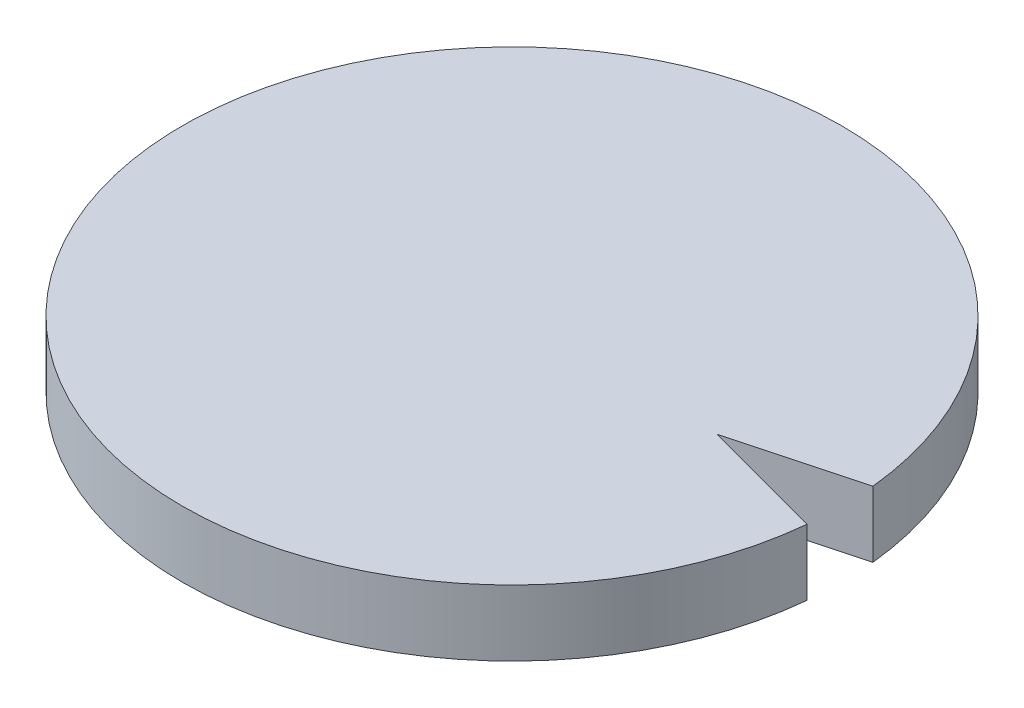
ISO-10303-21;
HEADER;
FILE_DESCRIPTION(('STEP AP214'),'2;1');
FILE_NAME('part.step','',(''),(''),'','','');
FILE_SCHEMA(('AUTOMOTIVE_DESIGN { 1 0 10303 214 1 1 1 1 }'));
ENDSEC;
DATA;
#1=APPLICATION_CONTEXT('core data for automotive mechanical design processes');
#2=APPLICATION_PROTOCOL_DEFINITION('international standard','automotive_design',2000,#1);
#3=PRODUCT_CONTEXT('',#1,'mechanical');
#4=PRODUCT('Part','Part','',(#3));
#5=PRODUCT_RELATED_PRODUCT_CATEGORY('part','',(#4));
#6=PRODUCT_DEFINITION_FORMATION('','',#4);
#7=PRODUCT_DEFINITION_CONTEXT('part definition',#1,'design');
#8=PRODUCT_DEFINITION('design','',#6,#7);
#9=PRODUCT_DEFINITION_SHAPE('','',#8);
#10=(LENGTH_UNIT() NAMED_UNIT(*) SI_UNIT(.MILLI.,.METRE.));
#11=(NAMED_UNIT(*) PLANE_ANGLE_UNIT() SI_UNIT($,.RADIAN.));
#12=(NAMED_UNIT(*) SI_UNIT($,.STERADIAN.) SOLID_ANGLE_UNIT());
#13=UNCERTAINTY_MEASURE_WITH_UNIT(LENGTH_MEASURE(1.E-05),#10,'distance_accuracy_value','');
#14=(GEOMETRIC_REPRESENTATION_CONTEXT(3) GLOBAL_UNCERTAINTY_ASSIGNED_CONTEXT((#13)) GLOBAL_UNIT_ASSIGNED_CONTEXT((#10,
#11,#12)) REPRESENTATION_CONTEXT('',''));
#15=CARTESIAN_POINT('',(0.,0.,0.));
#16=DIRECTION('',(0.,0.,1.));
#17=DIRECTION('',(1.,0.,0.));
#18=AXIS2_PLACEMENT_3D('',#15,#16,#17);
#19=CARTESIAN_POINT('',(31.0891178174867,5.,0.));
#20=DIRECTION('',(-0.258819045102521,0.,0.965925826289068));
#21=DIRECTION('',(0.965925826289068,0.,0.258819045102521));
#22=AXIS2_PLACEMENT_3D('',#19,#20,#21);
#23=PLANE('',#22);
#24=DIRECTION('',(-0.965925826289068,0.,-0.258819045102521));
#25=VECTOR('',#24,1.);
#26=CARTESIAN_POINT('',(31.0891178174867,-5.,0.));
#27=LINE('',#26,#25);
#28=CARTESIAN_POINT('',(49.749371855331,-5.,5.));
#29=VERTEX_POINT('',#28);
#30=CARTESIAN_POINT('',(31.0891178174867,-5.,0.));
#31=VERTEX_POINT('',#30);
#32=EDGE_CURVE('E65',#29,#31,#27,.T.);
#33=ORIENTED_EDGE('',*,*,#32,.T.);
#34=DIRECTION('',(0.,-1.,0.));
#35=VECTOR('',#34,1.);
#36=CARTESIAN_POINT('',(31.0891178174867,5.,0.));
#37=LINE('',#36,#35);
#38=CARTESIAN_POINT('',(31.0891178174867,5.,0.));
#39=VERTEX_POINT('',#38);
#40=EDGE_CURVE('E11',#39,#31,#37,.T.);
#41=ORIENTED_EDGE('',*,*,#40,.F.);
#42=DIRECTION('',(-0.965925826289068,0.,-0.258819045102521));
#43=VECTOR('',#42,1.);
#44=CARTESIAN_POINT('',(31.0891178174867,5.,0.));
#45=LINE('',#44,#43);
#46=CARTESIAN_POINT('',(49.749371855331,5.,5.));
#47=VERTEX_POINT('',#46);
#48=EDGE_CURVE('E79',#47,#39,#45,.T.);
#49=ORIENTED_EDGE('',*,*,#48,.F.);
#50=DIRECTION('',(0.,-1.,0.));
#51=VECTOR('',#50,1.);
#52=CARTESIAN_POINT('',(49.749371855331,5.,5.));
#53=LINE('',#52,#51);
#54=EDGE_CURVE('E75',#47,#29,#53,.T.);
#55=ORIENTED_EDGE('',*,*,#54,.T.);
#56=EDGE_LOOP('',(#33,#41,#49,#55));
#57=FACE_BOUND('',#56,.T.);
#58=ADVANCED_FACE('F29',(#57),#23,.F.);
#59=CARTESIAN_POINT('',(31.0891178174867,5.,0.));
#60=DIRECTION('',(-0.258819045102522,0.,-0.965925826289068));
#61=DIRECTION('',(-0.965925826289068,0.,0.258819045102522));
#62=AXIS2_PLACEMENT_3D('',#59,#60,#61);
#63=PLANE('',#62);
#64=DIRECTION('',(0.965925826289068,0.,-0.258819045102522));
#65=VECTOR('',#64,1.);
#66=CARTESIAN_POINT('',(31.0891178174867,-5.,0.));
#67=LINE('',#66,#65);
#68=CARTESIAN_POINT('',(49.749371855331,-5.,-5.));
#69=VERTEX_POINT('',#68);
#70=EDGE_CURVE('E62',#31,#69,#67,.T.);
#71=ORIENTED_EDGE('',*,*,#70,.T.);
#72=DIRECTION('',(0.,-1.,0.));
#73=VECTOR('',#72,1.);
#74=CARTESIAN_POINT('',(49.749371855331,5.,-5.));
#75=LINE('',#74,#73);
#76=CARTESIAN_POINT('',(49.749371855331,5.,-5.));
#77=VERTEX_POINT('',#76);
#78=EDGE_CURVE('E36',#77,#69,#75,.T.);
#79=ORIENTED_EDGE('',*,*,#78,.F.);
#80=DIRECTION('',(0.965925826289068,0.,-0.258819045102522));
#81=VECTOR('',#80,1.);
#82=CARTESIAN_POINT('',(31.0891178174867,5.,0.));
#83=LINE('',#82,#81);
#84=EDGE_CURVE('E47',#39,#77,#83,.T.);
#85=ORIENTED_EDGE('',*,*,#84,.F.);
#86=ORIENTED_EDGE('',*,*,#40,.T.);
#87=EDGE_LOOP('',(#71,#79,#85,#86));
#88=FACE_BOUND('',#87,.T.);
#89=ADVANCED_FACE('F71',(#88),#63,.F.);
#90=CARTESIAN_POINT('',(0.,5.,0.));
#91=DIRECTION('',(0.,-1.,0.));
#92=DIRECTION('',(0.,0.,-1.));
#93=AXIS2_PLACEMENT_3D('',#90,#91,#92);
#94=CYLINDRICAL_SURFACE('',#93,50.);
#95=CARTESIAN_POINT('',(0.,-5.,0.));
#96=DIRECTION('',(0.,1.,0.));
#97=DIRECTION('',(0.,0.,1.));
#98=AXIS2_PLACEMENT_3D('',#95,#96,#97);
#99=CIRCLE('',#98,50.);
#100=EDGE_CURVE('E66',#69,#29,#99,.T.);
#101=ORIENTED_EDGE('',*,*,#100,.T.);
#102=ORIENTED_EDGE('',*,*,#54,.F.);
#103=CARTESIAN_POINT('',(0.,5.,0.));
#104=DIRECTION('',(0.,1.,0.));
#105=DIRECTION('',(0.,0.,1.));
#106=AXIS2_PLACEMENT_3D('',#103,#104,#105);
#107=CIRCLE('',#106,50.);
#108=EDGE_CURVE('E43',#77,#47,#107,.T.);
#109=ORIENTED_EDGE('',*,*,#108,.F.);
#110=ORIENTED_EDGE('',*,*,#78,.T.);
#111=EDGE_LOOP('',(#101,#102,#109,#110));
#112=FACE_BOUND('',#111,.T.);
#113=ADVANCED_FACE('F84',(#112),#94,.T.);
#114=CARTESIAN_POINT('',(0.,5.,0.));
#115=DIRECTION('',(0.,1.,0.));
#116=DIRECTION('',(0.,0.,1.));
#117=AXIS2_PLACEMENT_3D('',#114,#115,#116);
#118=PLANE('',#117);
#119=ORIENTED_EDGE('',*,*,#48,.T.);
#120=ORIENTED_EDGE('',*,*,#84,.T.);
#121=ORIENTED_EDGE('',*,*,#108,.T.);
#122=EDGE_LOOP('',(#119,#120,#121));
#123=FACE_BOUND('',#122,.T.);
#124=ADVANCED_FACE('F85',(#123),#118,.T.);
#125=CARTESIAN_POINT('',(0.,-5.,0.));
#126=DIRECTION('',(0.,1.,0.));
#127=DIRECTION('',(0.,0.,1.));
#128=AXIS2_PLACEMENT_3D('',#125,#126,#127);
#129=PLANE('',#128);
#130=ORIENTED_EDGE('',*,*,#32,.F.);
#131=ORIENTED_EDGE('',*,*,#100,.F.);
#132=ORIENTED_EDGE('',*,*,#70,.F.);
#133=EDGE_LOOP('',(#130,#131,#132));
#134=FACE_BOUND('',#133,.T.);
#135=ADVANCED_FACE('F63',(#134),#129,.F.);
#136=CLOSED_SHELL('',(#58,#89,#113,#124,#135));
#137=MANIFOLD_SOLID_BREP('B2',#136);
#138=ADVANCED_BREP_SHAPE_REPRESENTATION('',(#18,#137),#14);
#139=SHAPE_DEFINITION_REPRESENTATION(#9,#138);
ENDSEC;
END-ISO-10303-21;
